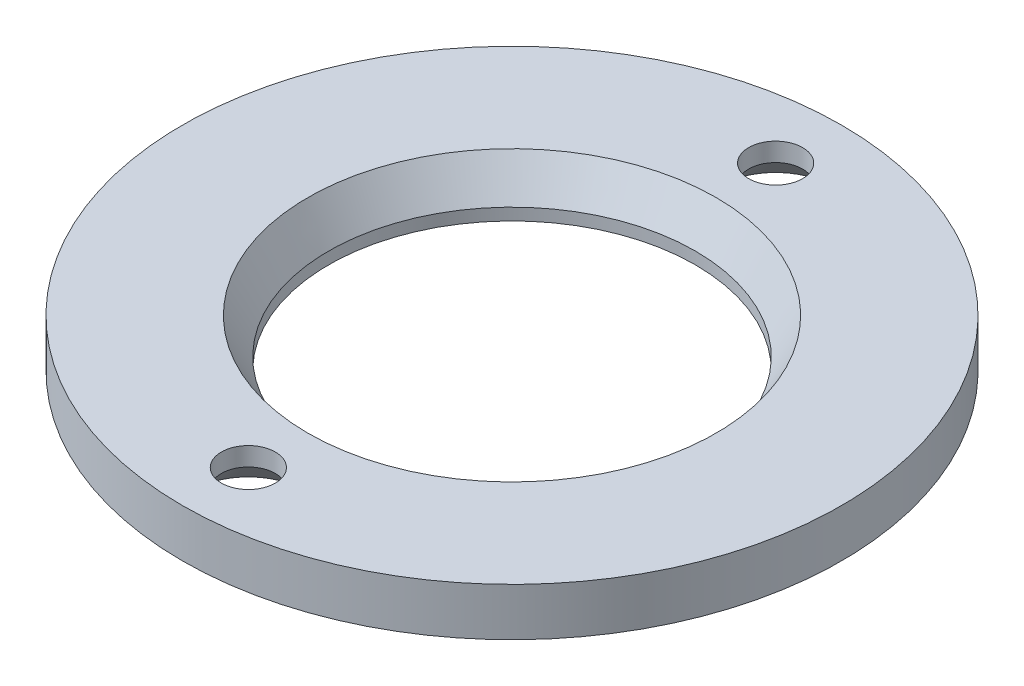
from build123d import *

# Parameters (mm, degrees)
SKETCH1_R                                      = 27.5
BOSS_EXTRUDE1_DEPTH                            = 4
CSK_FOR_M4_FLAT_HEAD_MACHINE_SCREW1_AT_2_COUNT = 2
CSK_FOR_M4_FLAT_HEAD_MACHINE_SCREW1_AT_2_PITCH = 44


with BuildPart() as part:
    # Sketch1 → Boss-Extrude1 (new body)
    with BuildSketch(Plane(origin=(0, 0, 0), x_dir=(1, 0, 0), z_dir=(0, 1, 0))):
        with Locations(Location((0, 0, 0), (0, 0, 270))):
            Circle(SKETCH1_R)
    extrude(amount=BOSS_EXTRUDE1_DEPTH)

    # Sketch2 → Cut-Revolve1 (revolve, cut)
    with BuildSketch(Plane(origin=(0, 0, 0), x_dir=(0, 0, -1), z_dir=(1, 0, 0))):
        Polygon((0, 0), (0, 4), (17.032050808, 4), (15.3, 1), (15.3, 0), align=None)
    revolve(axis=Axis((0, 0, 0), (0, 1, 0)), mode=Mode.SUBTRACT)

    # Sketch5 → CSK for M4 Flat Head Machine Screw1 (revolve, cut)
    with BuildSketch(Plane(origin=(0, 0, 22), x_dir=(0, 0, -1), z_dir=(1, 0, 0))):
        Polygon((0, 0), (0, 4), (2.25, 4), (2.25, 2.45), (4.7, 0), align=None)
    csk_for_m4_flat_head_machine_screw1 = revolve(axis=Axis((0, -6.35, 22), (0, 1, 0)), mode=Mode.SUBTRACT)

    # CSK for M4 Flat Head Machine Screw1 at 2: CSK for M4 Flat Head Machine Screw1 ×2
    with Locations(*[(0, 0, -i * CSK_FOR_M4_FLAT_HEAD_MACHINE_SCREW1_AT_2_PITCH) for i in range(1, CSK_FOR_M4_FLAT_HEAD_MACHINE_SCREW1_AT_2_COUNT)]):
        add(csk_for_m4_flat_head_machine_screw1, mode=Mode.SUBTRACT)


solid = part.part
